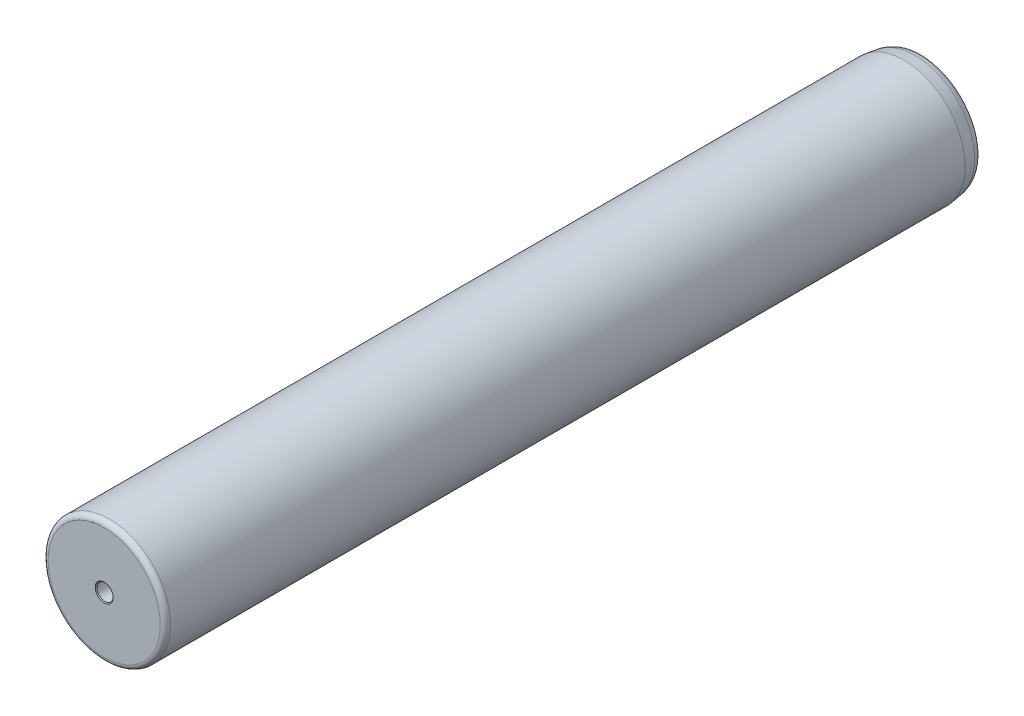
ISO-10303-21;
HEADER;
FILE_DESCRIPTION(('STEP AP214'),'2;1');
FILE_NAME('part.step','',(''),(''),'','','');
FILE_SCHEMA(('AUTOMOTIVE_DESIGN { 1 0 10303 214 1 1 1 1 }'));
ENDSEC;
DATA;
#1=APPLICATION_CONTEXT('core data for automotive mechanical design processes');
#2=APPLICATION_PROTOCOL_DEFINITION('international standard','automotive_design',2000,#1);
#3=PRODUCT_CONTEXT('',#1,'mechanical');
#4=PRODUCT('Part','Part','',(#3));
#5=PRODUCT_RELATED_PRODUCT_CATEGORY('part','',(#4));
#6=PRODUCT_DEFINITION_FORMATION('','',#4);
#7=PRODUCT_DEFINITION_CONTEXT('part definition',#1,'design');
#8=PRODUCT_DEFINITION('design','',#6,#7);
#9=PRODUCT_DEFINITION_SHAPE('','',#8);
#10=(LENGTH_UNIT() NAMED_UNIT(*) SI_UNIT(.MILLI.,.METRE.));
#11=(NAMED_UNIT(*) PLANE_ANGLE_UNIT() SI_UNIT($,.RADIAN.));
#12=(NAMED_UNIT(*) SI_UNIT($,.STERADIAN.) SOLID_ANGLE_UNIT());
#13=UNCERTAINTY_MEASURE_WITH_UNIT(LENGTH_MEASURE(1.E-05),#10,'distance_accuracy_value','');
#14=(GEOMETRIC_REPRESENTATION_CONTEXT(3) GLOBAL_UNCERTAINTY_ASSIGNED_CONTEXT((#13)) GLOBAL_UNIT_ASSIGNED_CONTEXT((#10,
#11,#12)) REPRESENTATION_CONTEXT('',''));
#15=CARTESIAN_POINT('',(0.,0.,0.));
#16=DIRECTION('',(0.,0.,1.));
#17=DIRECTION('',(1.,0.,0.));
#18=AXIS2_PLACEMENT_3D('',#15,#16,#17);
#19=CARTESIAN_POINT('',(0.,0.,0.));
#20=DIRECTION('',(0.,0.,-1.));
#21=DIRECTION('',(-1.,0.,0.));
#22=AXIS2_PLACEMENT_3D('',#19,#20,#21);
#23=PLANE('',#22);
#24=CARTESIAN_POINT('',(0.,0.,0.));
#25=DIRECTION('',(0.,0.,-1.));
#26=DIRECTION('',(-1.,0.,0.));
#27=AXIS2_PLACEMENT_3D('',#24,#25,#26);
#28=CIRCLE('',#27,4.4);
#29=CARTESIAN_POINT('',(-4.4,0.,0.));
#30=VERTEX_POINT('',#29);
#31=EDGE_CURVE('E23',#30,#30,#28,.T.);
#32=ORIENTED_EDGE('',*,*,#31,.T.);
#33=EDGE_LOOP('',(#32));
#34=FACE_BOUND('',#33,.T.);
#35=CARTESIAN_POINT('',(0.,0.,0.));
#36=DIRECTION('',(0.,0.,-1.));
#37=DIRECTION('',(-1.,0.,0.));
#38=AXIS2_PLACEMENT_3D('',#35,#36,#37);
#39=CIRCLE('',#38,27.5);
#40=CARTESIAN_POINT('',(-27.5,0.,0.));
#41=VERTEX_POINT('',#40);
#42=EDGE_CURVE('E63',#41,#41,#39,.F.);
#43=ORIENTED_EDGE('',*,*,#42,.T.);
#44=EDGE_LOOP('',(#43));
#45=FACE_BOUND('',#44,.T.);
#46=ADVANCED_FACE('F15',(#34,#45),#23,.F.);
#47=CARTESIAN_POINT('',(0.,0.,0.));
#48=DIRECTION('',(0.,0.,1.));
#49=DIRECTION('',(1.,0.,0.));
#50=AXIS2_PLACEMENT_3D('',#47,#48,#49);
#51=CYLINDRICAL_SURFACE('',#50,30.);
#52=CARTESIAN_POINT('',(0.,0.,-2.5));
#53=DIRECTION('',(0.,0.,-1.));
#54=DIRECTION('',(-1.,0.,0.));
#55=AXIS2_PLACEMENT_3D('',#52,#53,#54);
#56=CIRCLE('',#55,30.);
#57=CARTESIAN_POINT('',(-30.,0.,-2.5));
#58=VERTEX_POINT('',#57);
#59=EDGE_CURVE('E66',#58,#58,#56,.T.);
#60=ORIENTED_EDGE('',*,*,#59,.T.);
#61=EDGE_LOOP('',(#60));
#62=FACE_BOUND('',#61,.T.);
#63=CARTESIAN_POINT('',(0.,0.,-392.));
#64=DIRECTION('',(0.,0.,1.));
#65=DIRECTION('',(1.,0.,0.));
#66=AXIS2_PLACEMENT_3D('',#63,#64,#65);
#67=CIRCLE('',#66,30.);
#68=CARTESIAN_POINT('',(30.,0.,-392.));
#69=VERTEX_POINT('',#68);
#70=EDGE_CURVE('E60',#69,#69,#67,.T.);
#71=ORIENTED_EDGE('',*,*,#70,.T.);
#72=EDGE_LOOP('',(#71));
#73=FACE_BOUND('',#72,.T.);
#74=ADVANCED_FACE('F90',(#62,#73),#51,.T.);
#75=CARTESIAN_POINT('',(0.,0.,-397.42));
#76=DIRECTION('',(0.,0.,1.));
#77=DIRECTION('',(1.,0.,0.));
#78=AXIS2_PLACEMENT_3D('',#75,#76,#77);
#79=CONICAL_SURFACE('',#78,29.238268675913,0.139626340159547);
#80=ORIENTED_EDGE('',*,*,#70,.F.);
#81=EDGE_LOOP('',(#80));
#82=FACE_BOUND('',#81,.T.);
#83=CARTESIAN_POINT('',(0.,0.,-397.42));
#84=DIRECTION('',(0.,0.,1.));
#85=DIRECTION('',(1.,0.,0.));
#86=AXIS2_PLACEMENT_3D('',#83,#84,#85);
#87=CIRCLE('',#86,29.238268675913);
#88=CARTESIAN_POINT('',(29.238268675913,0.,-397.42));
#89=VERTEX_POINT('',#88);
#90=EDGE_CURVE('E57',#89,#89,#87,.T.);
#91=ORIENTED_EDGE('',*,*,#90,.T.);
#92=EDGE_LOOP('',(#91));
#93=FACE_BOUND('',#92,.T.);
#94=ADVANCED_FACE('F96',(#82,#93),#79,.T.);
#95=CARTESIAN_POINT('',(0.,0.,-396.509620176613));
#96=DIRECTION('',(0.,0.,1.));
#97=DIRECTION('',(1.,0.,0.));
#98=AXIS2_PLACEMENT_3D('',#95,#96,#97);
#99=TOROIDAL_SURFACE('',#98,22.7605796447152,6.54134898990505);
#100=ORIENTED_EDGE('',*,*,#90,.F.);
#101=EDGE_LOOP('',(#100));
#102=FACE_BOUND('',#101,.T.);
#103=CARTESIAN_POINT('',(0.,0.,-400.));
#104=DIRECTION('',(0.,0.,1.));
#105=DIRECTION('',(1.,0.,0.));
#106=AXIS2_PLACEMENT_3D('',#103,#104,#105);
#107=CIRCLE('',#106,28.2928933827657);
#108=CARTESIAN_POINT('',(28.2928933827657,0.,-400.));
#109=VERTEX_POINT('',#108);
#110=EDGE_CURVE('E53',#109,#109,#107,.T.);
#111=ORIENTED_EDGE('',*,*,#110,.T.);
#112=EDGE_LOOP('',(#111));
#113=FACE_BOUND('',#112,.T.);
#114=ADVANCED_FACE('F122',(#102,#113),#99,.T.);
#115=CARTESIAN_POINT('',(0.,0.,-400.));
#116=DIRECTION('',(0.,0.,1.));
#117=DIRECTION('',(1.,0.,0.));
#118=AXIS2_PLACEMENT_3D('',#115,#116,#117);
#119=PLANE('',#118);
#120=CARTESIAN_POINT('',(0.,0.,-400.));
#121=DIRECTION('',(0.,0.,1.));
#122=DIRECTION('',(1.,0.,0.));
#123=AXIS2_PLACEMENT_3D('',#120,#121,#122);
#124=CIRCLE('',#123,4.4);
#125=CARTESIAN_POINT('',(4.4,0.,-400.));
#126=VERTEX_POINT('',#125);
#127=EDGE_CURVE('E69',#126,#126,#124,.T.);
#128=ORIENTED_EDGE('',*,*,#127,.T.);
#129=EDGE_LOOP('',(#128));
#130=FACE_BOUND('',#129,.T.);
#131=ORIENTED_EDGE('',*,*,#110,.F.);
#132=EDGE_LOOP('',(#131));
#133=FACE_BOUND('',#132,.T.);
#134=ADVANCED_FACE('F104',(#130,#133),#119,.F.);
#135=CARTESIAN_POINT('',(0.,0.,-2.5));
#136=DIRECTION('',(0.,0.,-1.));
#137=DIRECTION('',(-1.,0.,0.));
#138=AXIS2_PLACEMENT_3D('',#135,#136,#137);
#139=TOROIDAL_SURFACE('',#138,27.5,2.5);
#140=ORIENTED_EDGE('',*,*,#59,.F.);
#141=EDGE_LOOP('',(#140));
#142=FACE_BOUND('',#141,.T.);
#143=ORIENTED_EDGE('',*,*,#42,.F.);
#144=EDGE_LOOP('',(#143));
#145=FACE_BOUND('',#144,.T.);
#146=ADVANCED_FACE('F101',(#142,#145),#139,.T.);
#147=CARTESIAN_POINT('',(0.,0.,-399.));
#148=DIRECTION('',(0.,0.,-1.));
#149=DIRECTION('',(-1.,0.,0.));
#150=AXIS2_PLACEMENT_3D('',#147,#148,#149);
#151=CONICAL_SURFACE('',#150,3.4,0.785398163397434);
#152=CARTESIAN_POINT('',(0.,0.,-399.6));
#153=DIRECTION('',(0.,0.,-1.));
#154=DIRECTION('',(-1.,0.,0.));
#155=AXIS2_PLACEMENT_3D('',#152,#153,#154);
#156=CIRCLE('',#155,4.);
#157=CARTESIAN_POINT('',(-4.,0.,-399.6));
#158=VERTEX_POINT('',#157);
#159=EDGE_CURVE('E43',#158,#158,#156,.T.);
#160=ORIENTED_EDGE('',*,*,#159,.F.);
#161=EDGE_LOOP('',(#160));
#162=FACE_BOUND('',#161,.T.);
#163=ORIENTED_EDGE('',*,*,#127,.F.);
#164=EDGE_LOOP('',(#163));
#165=FACE_BOUND('',#164,.T.);
#166=ADVANCED_FACE('F103',(#162,#165),#151,.F.);
#167=CARTESIAN_POINT('',(0.,0.,-390.));
#168=DIRECTION('',(0.,0.,-1.));
#169=DIRECTION('',(-1.,0.,0.));
#170=AXIS2_PLACEMENT_3D('',#167,#168,#169);
#171=PLANE('',#170);
#172=CARTESIAN_POINT('',(0.,0.,-390.));
#173=DIRECTION('',(0.,0.,-1.));
#174=DIRECTION('',(-1.,0.,0.));
#175=AXIS2_PLACEMENT_3D('',#172,#173,#174);
#176=CIRCLE('',#175,4.);
#177=CARTESIAN_POINT('',(-4.,0.,-390.));
#178=VERTEX_POINT('',#177);
#179=EDGE_CURVE('E39',#178,#178,#176,.T.);
#180=ORIENTED_EDGE('',*,*,#179,.T.);
#181=EDGE_LOOP('',(#180));
#182=FACE_BOUND('',#181,.T.);
#183=CARTESIAN_POINT('',(0.,0.,-390.));
#184=DIRECTION('',(0.,0.,-1.));
#185=DIRECTION('',(-1.,0.,0.));
#186=AXIS2_PLACEMENT_3D('',#183,#184,#185);
#187=CIRCLE('',#186,3.4);
#188=CARTESIAN_POINT('',(-3.4,0.,-390.));
#189=VERTEX_POINT('',#188);
#190=EDGE_CURVE('E54',#189,#189,#187,.F.);
#191=ORIENTED_EDGE('',*,*,#190,.T.);
#192=EDGE_LOOP('',(#191));
#193=FACE_BOUND('',#192,.T.);
#194=ADVANCED_FACE('F107',(#182,#193),#171,.T.);
#195=CARTESIAN_POINT('',(0.,0.,-390.));
#196=DIRECTION('',(0.,0.,-1.));
#197=DIRECTION('',(-1.,0.,0.));
#198=AXIS2_PLACEMENT_3D('',#195,#196,#197);
#199=CYLINDRICAL_SURFACE('',#198,4.);
#200=ORIENTED_EDGE('',*,*,#159,.T.);
#201=EDGE_LOOP('',(#200));
#202=FACE_BOUND('',#201,.T.);
#203=ORIENTED_EDGE('',*,*,#179,.F.);
#204=EDGE_LOOP('',(#203));
#205=FACE_BOUND('',#204,.T.);
#206=ADVANCED_FACE('F113',(#202,#205),#199,.F.);
#207=CARTESIAN_POINT('',(0.,0.,-384.));
#208=DIRECTION('',(0.,0.,-1.));
#209=DIRECTION('',(-1.,0.,0.));
#210=AXIS2_PLACEMENT_3D('',#207,#208,#209);
#211=CONICAL_SURFACE('',#210,3.4,1.02974425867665);
#212=CARTESIAN_POINT('',(0.,0.,-381.957073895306));
#213=VERTEX_POINT('',#212);
#214=VERTEX_LOOP('',#213);
#215=FACE_BOUND('',#214,.T.);
#216=CARTESIAN_POINT('',(0.,0.,-384.));
#217=DIRECTION('',(0.,0.,-1.));
#218=DIRECTION('',(-1.,0.,0.));
#219=AXIS2_PLACEMENT_3D('',#216,#217,#218);
#220=CIRCLE('',#219,3.4);
#221=CARTESIAN_POINT('',(-3.4,0.,-384.));
#222=VERTEX_POINT('',#221);
#223=EDGE_CURVE('E50',#222,#222,#220,.T.);
#224=ORIENTED_EDGE('',*,*,#223,.T.);
#225=EDGE_LOOP('',(#224));
#226=FACE_BOUND('',#225,.T.);
#227=ADVANCED_FACE('F136',(#215,#226),#211,.F.);
#228=CARTESIAN_POINT('',(0.,0.,-400.));
#229=DIRECTION('',(0.,0.,-1.));
#230=DIRECTION('',(-1.,0.,0.));
#231=AXIS2_PLACEMENT_3D('',#228,#229,#230);
#232=CYLINDRICAL_SURFACE('',#231,3.4);
#233=ORIENTED_EDGE('',*,*,#223,.F.);
#234=EDGE_LOOP('',(#233));
#235=FACE_BOUND('',#234,.T.);
#236=ORIENTED_EDGE('',*,*,#190,.F.);
#237=EDGE_LOOP('',(#236));
#238=FACE_BOUND('',#237,.T.);
#239=ADVANCED_FACE('F139',(#235,#238),#232,.F.);
#240=CARTESIAN_POINT('',(0.,0.,-10.));
#241=DIRECTION('',(0.,0.,1.));
#242=DIRECTION('',(-1.,0.,0.));
#243=AXIS2_PLACEMENT_3D('',#240,#241,#242);
#244=PLANE('',#243);
#245=CARTESIAN_POINT('',(0.,0.,-10.));
#246=DIRECTION('',(0.,0.,-1.));
#247=DIRECTION('',(-1.,0.,0.));
#248=AXIS2_PLACEMENT_3D('',#245,#246,#247);
#249=CIRCLE('',#248,4.);
#250=CARTESIAN_POINT('',(-4.,0.,-10.));
#251=VERTEX_POINT('',#250);
#252=EDGE_CURVE('E46',#251,#251,#249,.T.);
#253=ORIENTED_EDGE('',*,*,#252,.F.);
#254=EDGE_LOOP('',(#253));
#255=FACE_BOUND('',#254,.T.);
#256=CARTESIAN_POINT('',(0.,0.,-10.));
#257=DIRECTION('',(0.,0.,1.));
#258=DIRECTION('',(1.,0.,0.));
#259=AXIS2_PLACEMENT_3D('',#256,#257,#258);
#260=CIRCLE('',#259,3.4);
#261=CARTESIAN_POINT('',(3.4,0.,-10.));
#262=VERTEX_POINT('',#261);
#263=EDGE_CURVE('E40',#262,#262,#260,.F.);
#264=ORIENTED_EDGE('',*,*,#263,.T.);
#265=EDGE_LOOP('',(#264));
#266=FACE_BOUND('',#265,.T.);
#267=ADVANCED_FACE('F142',(#255,#266),#244,.T.);
#268=CARTESIAN_POINT('',(0.,0.,-10.));
#269=DIRECTION('',(0.,0.,1.));
#270=DIRECTION('',(1.,0.,0.));
#271=AXIS2_PLACEMENT_3D('',#268,#269,#270);
#272=CYLINDRICAL_SURFACE('',#271,4.);
#273=CARTESIAN_POINT('',(0.,0.,-0.399999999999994));
#274=DIRECTION('',(0.,0.,-1.));
#275=DIRECTION('',(-1.,0.,0.));
#276=AXIS2_PLACEMENT_3D('',#273,#274,#275);
#277=CIRCLE('',#276,4.);
#278=CARTESIAN_POINT('',(-4.,0.,-0.399999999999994));
#279=VERTEX_POINT('',#278);
#280=EDGE_CURVE('E9',#279,#279,#277,.F.);
#281=ORIENTED_EDGE('',*,*,#280,.T.);
#282=EDGE_LOOP('',(#281));
#283=FACE_BOUND('',#282,.T.);
#284=ORIENTED_EDGE('',*,*,#252,.T.);
#285=EDGE_LOOP('',(#284));
#286=FACE_BOUND('',#285,.T.);
#287=ADVANCED_FACE('F33',(#283,#286),#272,.F.);
#288=CARTESIAN_POINT('',(0.,0.,-16.));
#289=DIRECTION('',(0.,0.,1.));
#290=DIRECTION('',(1.,0.,0.));
#291=AXIS2_PLACEMENT_3D('',#288,#289,#290);
#292=CONICAL_SURFACE('',#291,3.4,1.02974425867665);
#293=CARTESIAN_POINT('',(0.,0.,-18.0429261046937));
#294=VERTEX_POINT('',#293);
#295=VERTEX_LOOP('',#294);
#296=FACE_BOUND('',#295,.T.);
#297=CARTESIAN_POINT('',(0.,0.,-16.));
#298=DIRECTION('',(0.,0.,1.));
#299=DIRECTION('',(1.,0.,0.));
#300=AXIS2_PLACEMENT_3D('',#297,#298,#299);
#301=CIRCLE('',#300,3.4);
#302=CARTESIAN_POINT('',(3.4,0.,-16.));
#303=VERTEX_POINT('',#302);
#304=EDGE_CURVE('E37',#303,#303,#301,.T.);
#305=ORIENTED_EDGE('',*,*,#304,.T.);
#306=EDGE_LOOP('',(#305));
#307=FACE_BOUND('',#306,.T.);
#308=ADVANCED_FACE('F29',(#296,#307),#292,.F.);
#309=CARTESIAN_POINT('',(0.,0.,0.));
#310=DIRECTION('',(0.,0.,1.));
#311=DIRECTION('',(1.,0.,0.));
#312=AXIS2_PLACEMENT_3D('',#309,#310,#311);
#313=CYLINDRICAL_SURFACE('',#312,3.4);
#314=ORIENTED_EDGE('',*,*,#304,.F.);
#315=EDGE_LOOP('',(#314));
#316=FACE_BOUND('',#315,.T.);
#317=ORIENTED_EDGE('',*,*,#263,.F.);
#318=EDGE_LOOP('',(#317));
#319=FACE_BOUND('',#318,.T.);
#320=ADVANCED_FACE('F32',(#316,#319),#313,.F.);
#321=CARTESIAN_POINT('',(0.,0.,0.));
#322=DIRECTION('',(0.,0.,1.));
#323=DIRECTION('',(1.,0.,0.));
#324=AXIS2_PLACEMENT_3D('',#321,#322,#323);
#325=CONICAL_SURFACE('',#324,4.4,0.785398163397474);
#326=ORIENTED_EDGE('',*,*,#280,.F.);
#327=EDGE_LOOP('',(#326));
#328=FACE_BOUND('',#327,.T.);
#329=ORIENTED_EDGE('',*,*,#31,.F.);
#330=EDGE_LOOP('',(#329));
#331=FACE_BOUND('',#330,.T.);
#332=ADVANCED_FACE('F17',(#328,#331),#325,.F.);
#333=CLOSED_SHELL('',(#46,#74,#94,#114,#134,#146,#166,#194,#206,#227,#239,#267,#287,#308,#320,#332));
#334=MANIFOLD_SOLID_BREP('B1',#333);
#335=ADVANCED_BREP_SHAPE_REPRESENTATION('',(#18,#334),#14);
#336=SHAPE_DEFINITION_REPRESENTATION(#9,#335);
ENDSEC;
END-ISO-10303-21;
